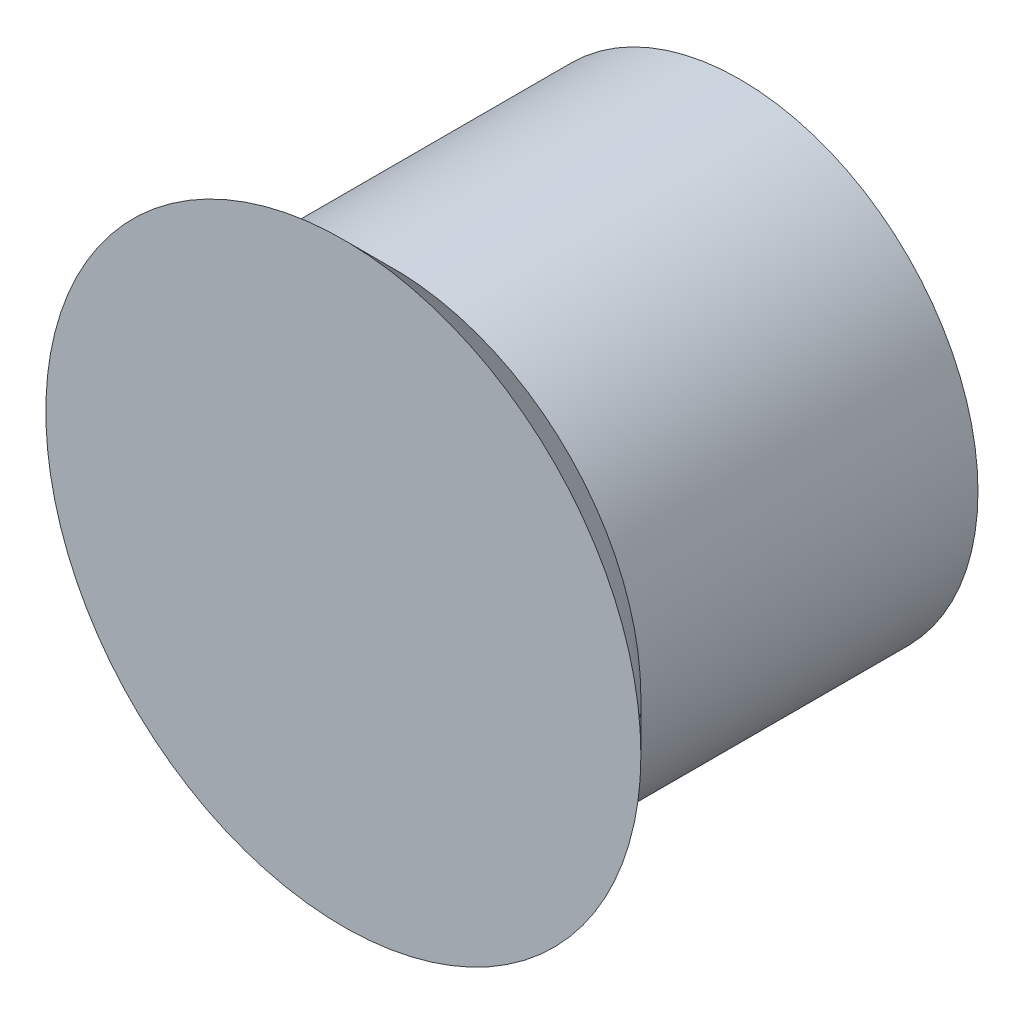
from build123d import *

# Parameters (mm, degrees)
IZIM1_R                     = 2.4
Y_KSEKLIK_EKSTR_ZYON1_DEPTH = 3.5
IZIM2_R                     = 2.500471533
Y_KSEKLIK_EKSTR_ZYON2_DEPTH = 0.5
Y_KSEKLIK_EKSTR_ZYON2_DRAFT = -45


with BuildPart() as part:
    # izim1 → Y_kseklik-Ekstr_zyon1 (new body)
    with BuildSketch(Plane.XY):
        Circle(IZIM1_R)
    extrude(amount=Y_KSEKLIK_EKSTR_ZYON1_DEPTH)


with BuildPart() as y_kseklik_ekstr_zyon2_tool:
    # izim2 → Y_kseklik-Ekstr_zyon2 (with draft: the straight prism first)
    with BuildSketch(Plane.XY.offset(3.5)):
        Circle(IZIM2_R)
    extrude(amount=Y_KSEKLIK_EKSTR_ZYON2_DEPTH)
    # Y_kseklik-Ekstr_zyon2: the draft: its side faces are tilted about the plane it starts from
    y_kseklik_ekstr_zyon2_sides = [y_kseklik_ekstr_zyon2_tool.faces().sort_by_distance(p)[0] for p in [
        (-2.500471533, 0, 3.75),
    ]]
    draft(y_kseklik_ekstr_zyon2_sides, Plane.XY.offset(3.5), Y_KSEKLIK_EKSTR_ZYON2_DRAFT)


with BuildPart() as part_1:
    add(part.part)

    # Y_kseklik-Ekstr_zyon2: add y_kseklik_ekstr_zyon2_tool
    add(y_kseklik_ekstr_zyon2_tool.part)


solid = part_1.part
